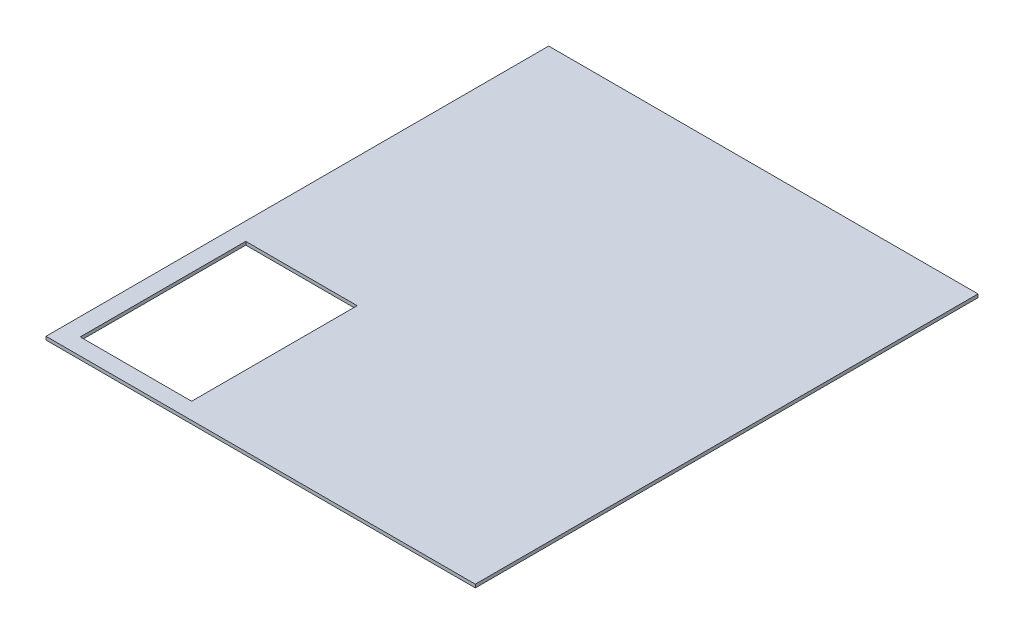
from build123d import *

# Parameters (mm, degrees)
SKETCH1_W           = 389
SKETCH1_H           = 455.5
BOSS_EXTRUDE1_DEPTH = 3
SKETCH2_W           = 100.960150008
SKETCH2_H           = 150
CUT_EXTRUDE1_DEPTH  = 600.007721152


with BuildPart() as part:
    # Sketch1 → Boss-Extrude1 (new body)
    with BuildSketch(Plane(origin=(0, 0, 0), x_dir=(1, 0, 0), z_dir=(0, 1, 0))):
        with Locations((194.5, 227.75)):
            Rectangle(SKETCH1_W, SKETCH1_H)
    extrude(amount=BOSS_EXTRUDE1_DEPTH)

    # Sketch2 → Cut-Extrude1 (cut, through all)
    with BuildSketch(Plane(origin=(0, 3, 0), x_dir=(1, 0, 0), z_dir=(0, 1, 0))):
        with Locations((66.480075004, 90)):
            Rectangle(SKETCH2_W, SKETCH2_H)
    extrude(amount=-CUT_EXTRUDE1_DEPTH, mode=Mode.SUBTRACT)


solid = part.part
